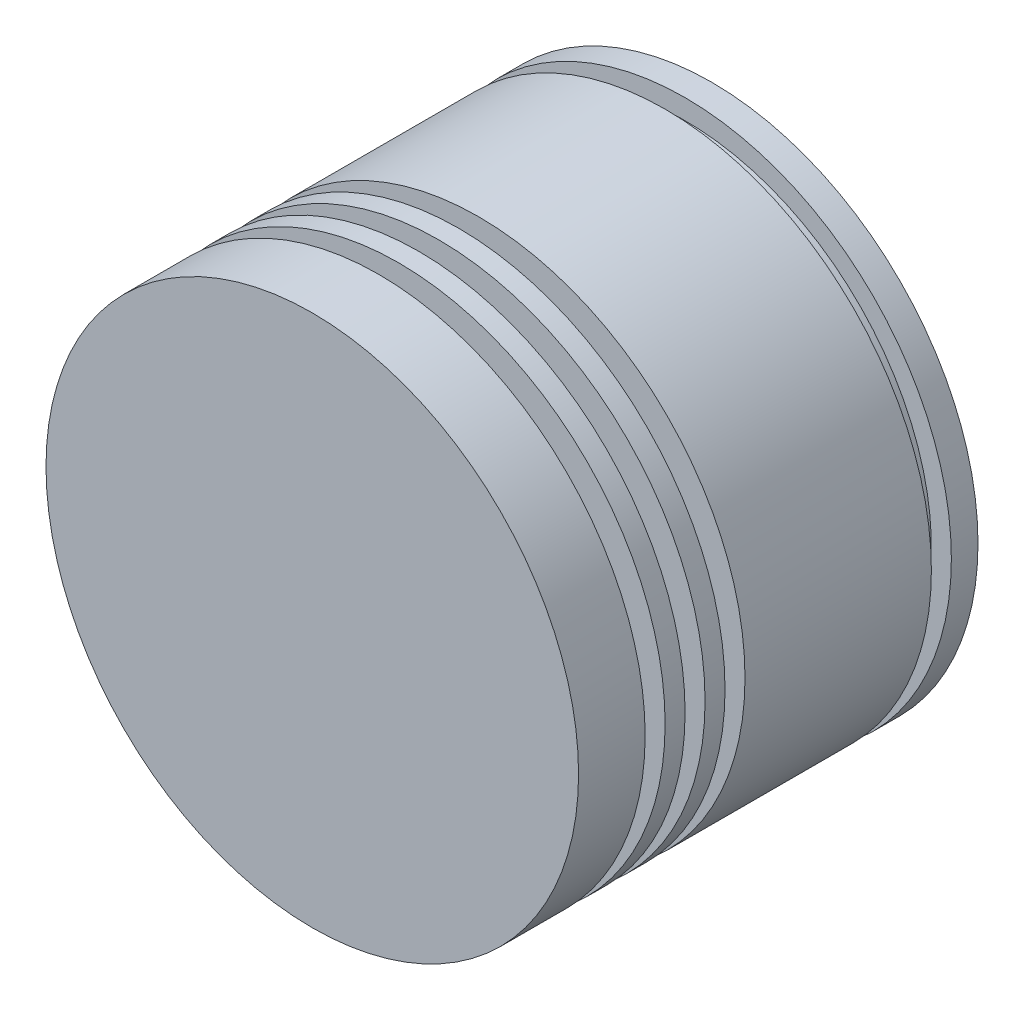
ISO-10303-21;
HEADER;
FILE_DESCRIPTION(('STEP AP214'),'2;1');
FILE_NAME('part.step','',(''),(''),'','','');
FILE_SCHEMA(('AUTOMOTIVE_DESIGN { 1 0 10303 214 1 1 1 1 }'));
ENDSEC;
DATA;
#1=APPLICATION_CONTEXT('core data for automotive mechanical design processes');
#2=APPLICATION_PROTOCOL_DEFINITION('international standard','automotive_design',2000,#1);
#3=PRODUCT_CONTEXT('',#1,'mechanical');
#4=PRODUCT('Part','Part','',(#3));
#5=PRODUCT_RELATED_PRODUCT_CATEGORY('part','',(#4));
#6=PRODUCT_DEFINITION_FORMATION('','',#4);
#7=PRODUCT_DEFINITION_CONTEXT('part definition',#1,'design');
#8=PRODUCT_DEFINITION('design','',#6,#7);
#9=PRODUCT_DEFINITION_SHAPE('','',#8);
#10=(LENGTH_UNIT() NAMED_UNIT(*) SI_UNIT(.MILLI.,.METRE.));
#11=(NAMED_UNIT(*) PLANE_ANGLE_UNIT() SI_UNIT($,.RADIAN.));
#12=(NAMED_UNIT(*) SI_UNIT($,.STERADIAN.) SOLID_ANGLE_UNIT());
#13=UNCERTAINTY_MEASURE_WITH_UNIT(LENGTH_MEASURE(1.E-05),#10,'distance_accuracy_value','');
#14=(GEOMETRIC_REPRESENTATION_CONTEXT(3) GLOBAL_UNCERTAINTY_ASSIGNED_CONTEXT((#13)) GLOBAL_UNIT_ASSIGNED_CONTEXT((#10,
#11,#12)) REPRESENTATION_CONTEXT('',''));
#15=CARTESIAN_POINT('',(0.,0.,0.));
#16=DIRECTION('',(0.,0.,1.));
#17=DIRECTION('',(1.,0.,0.));
#18=AXIS2_PLACEMENT_3D('',#15,#16,#17);
#19=CARTESIAN_POINT('',(0.,0.,-60.));
#20=DIRECTION('',(0.,0.,1.));
#21=DIRECTION('',(1.,0.,0.));
#22=AXIS2_PLACEMENT_3D('',#19,#20,#21);
#23=CYLINDRICAL_SURFACE('',#22,40.);
#24=CARTESIAN_POINT('',(0.,0.,-53.));
#25=DIRECTION('',(0.,0.,1.));
#26=DIRECTION('',(1.,0.,0.));
#27=AXIS2_PLACEMENT_3D('',#24,#25,#26);
#28=CIRCLE('',#27,40.);
#29=CARTESIAN_POINT('',(40.,0.,-53.));
#30=VERTEX_POINT('',#29);
#31=EDGE_CURVE('E40',#30,#30,#28,.F.);
#32=ORIENTED_EDGE('',*,*,#31,.F.);
#33=EDGE_LOOP('',(#32));
#34=FACE_BOUND('',#33,.T.);
#35=CARTESIAN_POINT('',(0.,0.,-25.));
#36=DIRECTION('',(0.,0.,1.));
#37=DIRECTION('',(1.,0.,0.));
#38=AXIS2_PLACEMENT_3D('',#35,#36,#37);
#39=CIRCLE('',#38,40.);
#40=CARTESIAN_POINT('',(40.,0.,-25.));
#41=VERTEX_POINT('',#40);
#42=EDGE_CURVE('E71',#41,#41,#39,.F.);
#43=ORIENTED_EDGE('',*,*,#42,.T.);
#44=EDGE_LOOP('',(#43));
#45=FACE_BOUND('',#44,.T.);
#46=ADVANCED_FACE('F36',(#34,#45),#23,.T.);
#47=CARTESIAN_POINT('',(0.,0.,-16.));
#48=DIRECTION('',(0.,0.,1.));
#49=DIRECTION('',(1.,0.,0.));
#50=AXIS2_PLACEMENT_3D('',#47,#48,#49);
#51=CIRCLE('',#50,40.);
#52=CARTESIAN_POINT('',(40.,0.,-16.));
#53=VERTEX_POINT('',#52);
#54=EDGE_CURVE('E61',#53,#53,#51,.F.);
#55=ORIENTED_EDGE('',*,*,#54,.F.);
#56=EDGE_LOOP('',(#55));
#57=FACE_BOUND('',#56,.T.);
#58=CARTESIAN_POINT('',(0.,0.,-13.));
#59=DIRECTION('',(0.,0.,1.));
#60=DIRECTION('',(1.,0.,0.));
#61=AXIS2_PLACEMENT_3D('',#58,#59,#60);
#62=CIRCLE('',#61,40.);
#63=CARTESIAN_POINT('',(40.,0.,-13.));
#64=VERTEX_POINT('',#63);
#65=EDGE_CURVE('E49',#64,#64,#62,.F.);
#66=ORIENTED_EDGE('',*,*,#65,.T.);
#67=EDGE_LOOP('',(#66));
#68=FACE_BOUND('',#67,.T.);
#69=ADVANCED_FACE('F120',(#57,#68),#23,.T.);
#70=CARTESIAN_POINT('',(0.,0.,-13.));
#71=DIRECTION('',(0.,0.,1.));
#72=DIRECTION('',(1.,0.,0.));
#73=AXIS2_PLACEMENT_3D('',#70,#71,#72);
#74=PLANE('',#73);
#75=ORIENTED_EDGE('',*,*,#65,.F.);
#76=EDGE_LOOP('',(#75));
#77=FACE_BOUND('',#76,.T.);
#78=CARTESIAN_POINT('',(0.,0.,-13.));
#79=DIRECTION('',(0.,0.,1.));
#80=DIRECTION('',(1.,0.,0.));
#81=AXIS2_PLACEMENT_3D('',#78,#79,#80);
#82=CIRCLE('',#81,35.);
#83=CARTESIAN_POINT('',(35.,0.,-13.));
#84=VERTEX_POINT('',#83);
#85=EDGE_CURVE('E58',#84,#84,#82,.T.);
#86=ORIENTED_EDGE('',*,*,#85,.F.);
#87=EDGE_LOOP('',(#86));
#88=FACE_BOUND('',#87,.T.);
#89=ADVANCED_FACE('F114',(#77,#88),#74,.T.);
#90=CARTESIAN_POINT('',(0.,0.,-10.));
#91=DIRECTION('',(0.,0.,1.));
#92=DIRECTION('',(1.,0.,0.));
#93=AXIS2_PLACEMENT_3D('',#90,#91,#92);
#94=PLANE('',#93);
#95=CARTESIAN_POINT('',(0.,0.,-10.));
#96=DIRECTION('',(0.,0.,1.));
#97=DIRECTION('',(1.,0.,0.));
#98=AXIS2_PLACEMENT_3D('',#95,#96,#97);
#99=CIRCLE('',#98,40.);
#100=CARTESIAN_POINT('',(40.,0.,-10.));
#101=VERTEX_POINT('',#100);
#102=EDGE_CURVE('E55',#101,#101,#99,.F.);
#103=ORIENTED_EDGE('',*,*,#102,.T.);
#104=EDGE_LOOP('',(#103));
#105=FACE_BOUND('',#104,.T.);
#106=CARTESIAN_POINT('',(0.,0.,-10.));
#107=DIRECTION('',(0.,0.,1.));
#108=DIRECTION('',(1.,0.,0.));
#109=AXIS2_PLACEMENT_3D('',#106,#107,#108);
#110=CIRCLE('',#109,35.);
#111=CARTESIAN_POINT('',(35.,0.,-10.));
#112=VERTEX_POINT('',#111);
#113=EDGE_CURVE('E52',#112,#112,#110,.T.);
#114=ORIENTED_EDGE('',*,*,#113,.T.);
#115=EDGE_LOOP('',(#114));
#116=FACE_BOUND('',#115,.T.);
#117=ADVANCED_FACE('F103',(#105,#116),#94,.F.);
#118=CARTESIAN_POINT('',(0.,0.,-13.));
#119=DIRECTION('',(0.,0.,1.));
#120=DIRECTION('',(1.,0.,0.));
#121=AXIS2_PLACEMENT_3D('',#118,#119,#120);
#122=CYLINDRICAL_SURFACE('',#121,35.);
#123=ORIENTED_EDGE('',*,*,#85,.T.);
#124=EDGE_LOOP('',(#123));
#125=FACE_BOUND('',#124,.T.);
#126=ORIENTED_EDGE('',*,*,#113,.F.);
#127=EDGE_LOOP('',(#126));
#128=FACE_BOUND('',#127,.T.);
#129=ADVANCED_FACE('F105',(#125,#128),#122,.T.);
#130=CARTESIAN_POINT('',(0.,0.,0.));
#131=DIRECTION('',(0.,0.,1.));
#132=DIRECTION('',(1.,0.,0.));
#133=AXIS2_PLACEMENT_3D('',#130,#131,#132);
#134=PLANE('',#133);
#135=CARTESIAN_POINT('',(0.,0.,0.));
#136=DIRECTION('',(0.,0.,1.));
#137=DIRECTION('',(1.,0.,0.));
#138=AXIS2_PLACEMENT_3D('',#135,#136,#137);
#139=CIRCLE('',#138,40.);
#140=CARTESIAN_POINT('',(40.,0.,0.));
#141=VERTEX_POINT('',#140);
#142=EDGE_CURVE('E44',#141,#141,#139,.T.);
#143=ORIENTED_EDGE('',*,*,#142,.T.);
#144=EDGE_LOOP('',(#143));
#145=FACE_BOUND('',#144,.T.);
#146=ADVANCED_FACE('F107',(#145),#134,.T.);
#147=ORIENTED_EDGE('',*,*,#102,.F.);
#148=EDGE_LOOP('',(#147));
#149=FACE_BOUND('',#148,.T.);
#150=ORIENTED_EDGE('',*,*,#142,.F.);
#151=EDGE_LOOP('',(#150));
#152=FACE_BOUND('',#151,.T.);
#153=ADVANCED_FACE('F38',(#149,#152),#23,.T.);
#154=CARTESIAN_POINT('',(0.,0.,-19.));
#155=DIRECTION('',(0.,0.,1.));
#156=DIRECTION('',(1.,0.,0.));
#157=AXIS2_PLACEMENT_3D('',#154,#155,#156);
#158=PLANE('',#157);
#159=CARTESIAN_POINT('',(0.,0.,-19.));
#160=DIRECTION('',(0.,0.,1.));
#161=DIRECTION('',(1.,0.,0.));
#162=AXIS2_PLACEMENT_3D('',#159,#160,#161);
#163=CIRCLE('',#162,40.);
#164=CARTESIAN_POINT('',(40.,0.,-19.));
#165=VERTEX_POINT('',#164);
#166=EDGE_CURVE('E64',#165,#165,#163,.F.);
#167=ORIENTED_EDGE('',*,*,#166,.F.);
#168=EDGE_LOOP('',(#167));
#169=FACE_BOUND('',#168,.T.);
#170=CARTESIAN_POINT('',(0.,0.,-19.));
#171=DIRECTION('',(0.,0.,1.));
#172=DIRECTION('',(1.,0.,0.));
#173=AXIS2_PLACEMENT_3D('',#170,#171,#172);
#174=CIRCLE('',#173,35.);
#175=CARTESIAN_POINT('',(35.,0.,-19.));
#176=VERTEX_POINT('',#175);
#177=EDGE_CURVE('E65',#176,#176,#174,.T.);
#178=ORIENTED_EDGE('',*,*,#177,.F.);
#179=EDGE_LOOP('',(#178));
#180=FACE_BOUND('',#179,.T.);
#181=ADVANCED_FACE('F134',(#169,#180),#158,.T.);
#182=CARTESIAN_POINT('',(0.,0.,-16.));
#183=DIRECTION('',(0.,0.,1.));
#184=DIRECTION('',(1.,0.,0.));
#185=AXIS2_PLACEMENT_3D('',#182,#183,#184);
#186=PLANE('',#185);
#187=ORIENTED_EDGE('',*,*,#54,.T.);
#188=EDGE_LOOP('',(#187));
#189=FACE_BOUND('',#188,.T.);
#190=CARTESIAN_POINT('',(0.,0.,-16.));
#191=DIRECTION('',(0.,0.,1.));
#192=DIRECTION('',(1.,0.,0.));
#193=AXIS2_PLACEMENT_3D('',#190,#191,#192);
#194=CIRCLE('',#193,35.);
#195=CARTESIAN_POINT('',(35.,0.,-16.));
#196=VERTEX_POINT('',#195);
#197=EDGE_CURVE('E74',#196,#196,#194,.T.);
#198=ORIENTED_EDGE('',*,*,#197,.T.);
#199=EDGE_LOOP('',(#198));
#200=FACE_BOUND('',#199,.T.);
#201=ADVANCED_FACE('F139',(#189,#200),#186,.F.);
#202=CARTESIAN_POINT('',(0.,0.,-19.));
#203=DIRECTION('',(0.,0.,1.));
#204=DIRECTION('',(1.,0.,0.));
#205=AXIS2_PLACEMENT_3D('',#202,#203,#204);
#206=CYLINDRICAL_SURFACE('',#205,35.);
#207=ORIENTED_EDGE('',*,*,#177,.T.);
#208=EDGE_LOOP('',(#207));
#209=FACE_BOUND('',#208,.T.);
#210=ORIENTED_EDGE('',*,*,#197,.F.);
#211=EDGE_LOOP('',(#210));
#212=FACE_BOUND('',#211,.T.);
#213=ADVANCED_FACE('F148',(#209,#212),#206,.T.);
#214=CARTESIAN_POINT('',(0.,0.,-22.));
#215=DIRECTION('',(0.,0.,1.));
#216=DIRECTION('',(1.,0.,0.));
#217=AXIS2_PLACEMENT_3D('',#214,#215,#216);
#218=CIRCLE('',#217,40.);
#219=CARTESIAN_POINT('',(40.,0.,-22.));
#220=VERTEX_POINT('',#219);
#221=EDGE_CURVE('E68',#220,#220,#218,.F.);
#222=ORIENTED_EDGE('',*,*,#221,.F.);
#223=EDGE_LOOP('',(#222));
#224=FACE_BOUND('',#223,.T.);
#225=ORIENTED_EDGE('',*,*,#166,.T.);
#226=EDGE_LOOP('',(#225));
#227=FACE_BOUND('',#226,.T.);
#228=ADVANCED_FACE('F127',(#224,#227),#23,.T.);
#229=CARTESIAN_POINT('',(0.,0.,-25.));
#230=DIRECTION('',(0.,0.,1.));
#231=DIRECTION('',(1.,0.,0.));
#232=AXIS2_PLACEMENT_3D('',#229,#230,#231);
#233=PLANE('',#232);
#234=ORIENTED_EDGE('',*,*,#42,.F.);
#235=EDGE_LOOP('',(#234));
#236=FACE_BOUND('',#235,.T.);
#237=CARTESIAN_POINT('',(0.,0.,-25.));
#238=DIRECTION('',(0.,0.,1.));
#239=DIRECTION('',(1.,0.,0.));
#240=AXIS2_PLACEMENT_3D('',#237,#238,#239);
#241=CIRCLE('',#240,35.);
#242=CARTESIAN_POINT('',(35.,0.,-25.));
#243=VERTEX_POINT('',#242);
#244=EDGE_CURVE('E72',#243,#243,#241,.T.);
#245=ORIENTED_EDGE('',*,*,#244,.F.);
#246=EDGE_LOOP('',(#245));
#247=FACE_BOUND('',#246,.T.);
#248=ADVANCED_FACE('F160',(#236,#247),#233,.T.);
#249=CARTESIAN_POINT('',(0.,0.,-22.));
#250=DIRECTION('',(0.,0.,1.));
#251=DIRECTION('',(1.,0.,0.));
#252=AXIS2_PLACEMENT_3D('',#249,#250,#251);
#253=PLANE('',#252);
#254=ORIENTED_EDGE('',*,*,#221,.T.);
#255=EDGE_LOOP('',(#254));
#256=FACE_BOUND('',#255,.T.);
#257=CARTESIAN_POINT('',(0.,0.,-22.));
#258=DIRECTION('',(0.,0.,1.));
#259=DIRECTION('',(1.,0.,0.));
#260=AXIS2_PLACEMENT_3D('',#257,#258,#259);
#261=CIRCLE('',#260,35.);
#262=CARTESIAN_POINT('',(35.,0.,-22.));
#263=VERTEX_POINT('',#262);
#264=EDGE_CURVE('E81',#263,#263,#261,.T.);
#265=ORIENTED_EDGE('',*,*,#264,.T.);
#266=EDGE_LOOP('',(#265));
#267=FACE_BOUND('',#266,.T.);
#268=ADVANCED_FACE('F156',(#256,#267),#253,.F.);
#269=CARTESIAN_POINT('',(0.,0.,-25.));
#270=DIRECTION('',(0.,0.,1.));
#271=DIRECTION('',(1.,0.,0.));
#272=AXIS2_PLACEMENT_3D('',#269,#270,#271);
#273=CYLINDRICAL_SURFACE('',#272,35.);
#274=ORIENTED_EDGE('',*,*,#244,.T.);
#275=EDGE_LOOP('',(#274));
#276=FACE_BOUND('',#275,.T.);
#277=ORIENTED_EDGE('',*,*,#264,.F.);
#278=EDGE_LOOP('',(#277));
#279=FACE_BOUND('',#278,.T.);
#280=ADVANCED_FACE('F159',(#276,#279),#273,.T.);
#281=CARTESIAN_POINT('',(-42.,0.,-53.));
#282=DIRECTION('',(0.,0.,1.));
#283=DIRECTION('',(1.,0.,0.));
#284=AXIS2_PLACEMENT_3D('',#281,#282,#283);
#285=PLANE('',#284);
#286=ORIENTED_EDGE('',*,*,#31,.T.);
#287=EDGE_LOOP('',(#286));
#288=FACE_BOUND('',#287,.T.);
#289=CARTESIAN_POINT('',(0.,0.,-53.));
#290=DIRECTION('',(0.,0.,-1.));
#291=DIRECTION('',(-1.,0.,0.));
#292=AXIS2_PLACEMENT_3D('',#289,#290,#291);
#293=CIRCLE('',#292,37.);
#294=CARTESIAN_POINT('',(-37.,0.,-53.));
#295=VERTEX_POINT('',#294);
#296=EDGE_CURVE('E77',#295,#295,#293,.T.);
#297=ORIENTED_EDGE('',*,*,#296,.F.);
#298=EDGE_LOOP('',(#297));
#299=FACE_BOUND('',#298,.T.);
#300=ADVANCED_FACE('F167',(#288,#299),#285,.F.);
#301=CARTESIAN_POINT('',(0.,0.,-60.));
#302=DIRECTION('',(0.,0.,-1.));
#303=DIRECTION('',(-1.,0.,0.));
#304=AXIS2_PLACEMENT_3D('',#301,#302,#303);
#305=CYLINDRICAL_SURFACE('',#304,37.);
#306=CARTESIAN_POINT('',(0.,0.,-56.));
#307=DIRECTION('',(0.,0.,-1.));
#308=DIRECTION('',(-1.,0.,0.));
#309=AXIS2_PLACEMENT_3D('',#306,#307,#308);
#310=CIRCLE('',#309,37.);
#311=CARTESIAN_POINT('',(-37.,0.,-56.));
#312=VERTEX_POINT('',#311);
#313=EDGE_CURVE('E83',#312,#312,#310,.T.);
#314=ORIENTED_EDGE('',*,*,#313,.F.);
#315=EDGE_LOOP('',(#314));
#316=FACE_BOUND('',#315,.T.);
#317=ORIENTED_EDGE('',*,*,#296,.T.);
#318=EDGE_LOOP('',(#317));
#319=FACE_BOUND('',#318,.T.);
#320=ADVANCED_FACE('F171',(#316,#319),#305,.T.);
#321=CARTESIAN_POINT('',(-42.,0.,-56.));
#322=DIRECTION('',(0.,0.,-1.));
#323=DIRECTION('',(-1.,0.,0.));
#324=AXIS2_PLACEMENT_3D('',#321,#322,#323);
#325=PLANE('',#324);
#326=CARTESIAN_POINT('',(0.,0.,-56.));
#327=DIRECTION('',(0.,0.,-1.));
#328=DIRECTION('',(-1.,0.,0.));
#329=AXIS2_PLACEMENT_3D('',#326,#327,#328);
#330=CIRCLE('',#329,40.);
#331=CARTESIAN_POINT('',(-40.,0.,-56.));
#332=VERTEX_POINT('',#331);
#333=EDGE_CURVE('E75',#332,#332,#330,.F.);
#334=ORIENTED_EDGE('',*,*,#333,.T.);
#335=EDGE_LOOP('',(#334));
#336=FACE_BOUND('',#335,.T.);
#337=ORIENTED_EDGE('',*,*,#313,.T.);
#338=EDGE_LOOP('',(#337));
#339=FACE_BOUND('',#338,.T.);
#340=ADVANCED_FACE('F175',(#336,#339),#325,.F.);
#341=CARTESIAN_POINT('',(0.,0.,-60.));
#342=DIRECTION('',(0.,0.,1.));
#343=DIRECTION('',(1.,0.,0.));
#344=AXIS2_PLACEMENT_3D('',#341,#342,#343);
#345=PLANE('',#344);
#346=CARTESIAN_POINT('',(0.,0.,-60.));
#347=DIRECTION('',(0.,0.,1.));
#348=DIRECTION('',(1.,0.,0.));
#349=AXIS2_PLACEMENT_3D('',#346,#347,#348);
#350=CIRCLE('',#349,40.);
#351=CARTESIAN_POINT('',(40.,0.,-60.));
#352=VERTEX_POINT('',#351);
#353=EDGE_CURVE('E11',#352,#352,#350,.T.);
#354=ORIENTED_EDGE('',*,*,#353,.F.);
#355=EDGE_LOOP('',(#354));
#356=FACE_BOUND('',#355,.T.);
#357=ADVANCED_FACE('F131',(#356),#345,.F.);
#358=ORIENTED_EDGE('',*,*,#333,.F.);
#359=EDGE_LOOP('',(#358));
#360=FACE_BOUND('',#359,.T.);
#361=ORIENTED_EDGE('',*,*,#353,.T.);
#362=EDGE_LOOP('',(#361));
#363=FACE_BOUND('',#362,.T.);
#364=ADVANCED_FACE('F122',(#360,#363),#23,.T.);
#365=CLOSED_SHELL('',(#46,#69,#89,#117,#129,#146,#153,#181,#201,#213,#228,#248,#268,#280,#300,
#320,#340,#357,#364));
#366=MANIFOLD_SOLID_BREP('B2',#365);
#367=ADVANCED_BREP_SHAPE_REPRESENTATION('',(#18,#366),#14);
#368=SHAPE_DEFINITION_REPRESENTATION(#9,#367);
ENDSEC;
END-ISO-10303-21;
